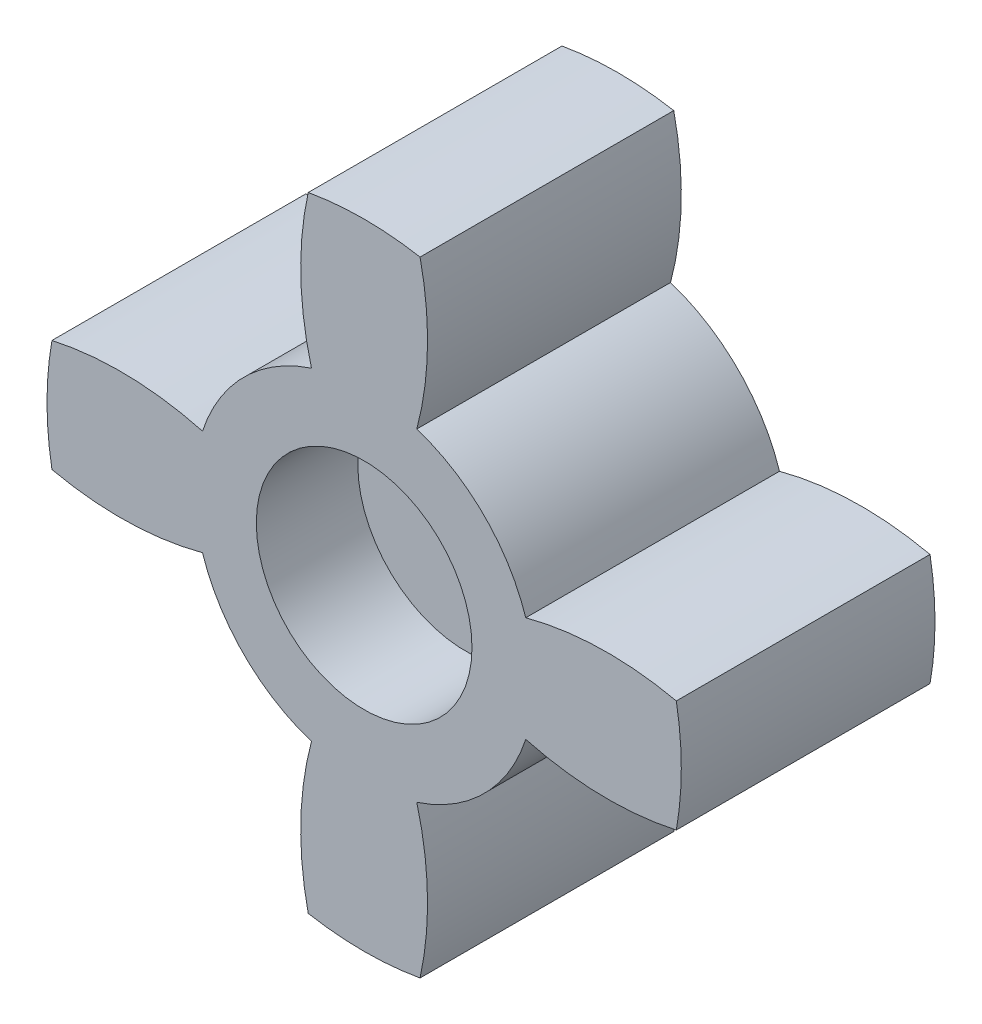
ISO-10303-21;
HEADER;
FILE_DESCRIPTION(('STEP AP214'),'2;1');
FILE_NAME('part.step','',(''),(''),'','','');
FILE_SCHEMA(('AUTOMOTIVE_DESIGN { 1 0 10303 214 1 1 1 1 }'));
ENDSEC;
DATA;
#1=APPLICATION_CONTEXT('core data for automotive mechanical design processes');
#2=APPLICATION_PROTOCOL_DEFINITION('international standard','automotive_design',2000,#1);
#3=PRODUCT_CONTEXT('',#1,'mechanical');
#4=PRODUCT('Part','Part','',(#3));
#5=PRODUCT_RELATED_PRODUCT_CATEGORY('part','',(#4));
#6=PRODUCT_DEFINITION_FORMATION('','',#4);
#7=PRODUCT_DEFINITION_CONTEXT('part definition',#1,'design');
#8=PRODUCT_DEFINITION('design','',#6,#7);
#9=PRODUCT_DEFINITION_SHAPE('','',#8);
#10=(LENGTH_UNIT() NAMED_UNIT(*) SI_UNIT(.MILLI.,.METRE.));
#11=(NAMED_UNIT(*) PLANE_ANGLE_UNIT() SI_UNIT($,.RADIAN.));
#12=(NAMED_UNIT(*) SI_UNIT($,.STERADIAN.) SOLID_ANGLE_UNIT());
#13=UNCERTAINTY_MEASURE_WITH_UNIT(LENGTH_MEASURE(1.E-05),#10,'distance_accuracy_value','');
#14=(GEOMETRIC_REPRESENTATION_CONTEXT(3) GLOBAL_UNCERTAINTY_ASSIGNED_CONTEXT((#13)) GLOBAL_UNIT_ASSIGNED_CONTEXT((#10,
#11,#12)) REPRESENTATION_CONTEXT('',''));
#15=CARTESIAN_POINT('',(0.,0.,0.));
#16=DIRECTION('',(0.,0.,1.));
#17=DIRECTION('',(1.,0.,0.));
#18=AXIS2_PLACEMENT_3D('',#15,#16,#17);
#19=CARTESIAN_POINT('',(0.,0.,10.));
#20=DIRECTION('',(0.,0.,-1.));
#21=DIRECTION('',(-1.,0.,0.));
#22=AXIS2_PLACEMENT_3D('',#19,#20,#21);
#23=CYLINDRICAL_SURFACE('',#22,12.5);
#24=CARTESIAN_POINT('',(0.,0.,10.));
#25=DIRECTION('',(0.,0.,1.));
#26=DIRECTION('',(1.,0.,0.));
#27=AXIS2_PLACEMENT_3D('',#24,#25,#26);
#28=CIRCLE('',#27,12.5);
#29=CARTESIAN_POINT('',(-2.20399556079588,-12.3041620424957,10.));
#30=VERTEX_POINT('',#29);
#31=CARTESIAN_POINT('',(2.20399556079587,-12.3041620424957,10.));
#32=VERTEX_POINT('',#31);
#33=EDGE_CURVE('E25',#30,#32,#28,.T.);
#34=ORIENTED_EDGE('',*,*,#33,.F.);
#35=DIRECTION('',(0.,0.,1.));
#36=VECTOR('',#35,1.);
#37=CARTESIAN_POINT('',(-2.20399556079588,-12.3041620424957,0.));
#38=LINE('',#37,#36);
#39=CARTESIAN_POINT('',(-2.20399556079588,-12.3041620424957,0.));
#40=VERTEX_POINT('',#39);
#41=EDGE_CURVE('E166',#40,#30,#38,.T.);
#42=ORIENTED_EDGE('',*,*,#41,.F.);
#43=CARTESIAN_POINT('',(0.,0.,0.));
#44=DIRECTION('',(0.,0.,1.));
#45=DIRECTION('',(1.,0.,0.));
#46=AXIS2_PLACEMENT_3D('',#43,#44,#45);
#47=CIRCLE('',#46,12.5);
#48=CARTESIAN_POINT('',(2.20399556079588,-12.3041620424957,0.));
#49=VERTEX_POINT('',#48);
#50=EDGE_CURVE('E40',#40,#49,#47,.T.);
#51=ORIENTED_EDGE('',*,*,#50,.T.);
#52=DIRECTION('',(0.,0.,1.));
#53=VECTOR('',#52,1.);
#54=CARTESIAN_POINT('',(2.20399556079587,-12.3041620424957,0.));
#55=LINE('',#54,#53);
#56=EDGE_CURVE('E192',#49,#32,#55,.T.);
#57=ORIENTED_EDGE('',*,*,#56,.T.);
#58=EDGE_LOOP('',(#34,#42,#51,#57));
#59=FACE_BOUND('',#58,.T.);
#60=ADVANCED_FACE('F15',(#59),#23,.T.);
#61=CARTESIAN_POINT('',(12.3041620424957,-2.20399556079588,10.));
#62=VERTEX_POINT('',#61);
#63=CARTESIAN_POINT('',(12.3041620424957,2.20399556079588,10.));
#64=VERTEX_POINT('',#63);
#65=EDGE_CURVE('E262',#62,#64,#28,.T.);
#66=ORIENTED_EDGE('',*,*,#65,.F.);
#67=DIRECTION('',(0.,0.,1.));
#68=VECTOR('',#67,1.);
#69=CARTESIAN_POINT('',(12.3041620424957,-2.20399556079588,0.));
#70=LINE('',#69,#68);
#71=CARTESIAN_POINT('',(12.3041620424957,-2.20399556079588,0.));
#72=VERTEX_POINT('',#71);
#73=EDGE_CURVE('E190',#72,#62,#70,.T.);
#74=ORIENTED_EDGE('',*,*,#73,.F.);
#75=CARTESIAN_POINT('',(12.3041620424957,2.20399556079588,0.));
#76=VERTEX_POINT('',#75);
#77=EDGE_CURVE('E241',#72,#76,#47,.T.);
#78=ORIENTED_EDGE('',*,*,#77,.T.);
#79=DIRECTION('',(0.,0.,1.));
#80=VECTOR('',#79,1.);
#81=CARTESIAN_POINT('',(12.3041620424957,2.20399556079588,0.));
#82=LINE('',#81,#80);
#83=EDGE_CURVE('E244',#76,#64,#82,.T.);
#84=ORIENTED_EDGE('',*,*,#83,.T.);
#85=EDGE_LOOP('',(#66,#74,#78,#84));
#86=FACE_BOUND('',#85,.T.);
#87=ADVANCED_FACE('F275',(#86),#23,.T.);
#88=CARTESIAN_POINT('',(2.20399556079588,12.3041620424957,0.));
#89=VERTEX_POINT('',#88);
#90=CARTESIAN_POINT('',(-2.20399556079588,12.3041620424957,0.));
#91=VERTEX_POINT('',#90);
#92=EDGE_CURVE('E19',#89,#91,#47,.T.);
#93=ORIENTED_EDGE('',*,*,#92,.T.);
#94=DIRECTION('',(0.,0.,1.));
#95=VECTOR('',#94,1.);
#96=CARTESIAN_POINT('',(-2.20399556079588,12.3041620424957,0.));
#97=LINE('',#96,#95);
#98=CARTESIAN_POINT('',(-2.20399556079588,12.3041620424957,10.));
#99=VERTEX_POINT('',#98);
#100=EDGE_CURVE('E205',#91,#99,#97,.T.);
#101=ORIENTED_EDGE('',*,*,#100,.T.);
#102=CARTESIAN_POINT('',(2.20399556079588,12.3041620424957,10.));
#103=VERTEX_POINT('',#102);
#104=EDGE_CURVE('E9',#103,#99,#28,.T.);
#105=ORIENTED_EDGE('',*,*,#104,.F.);
#106=DIRECTION('',(0.,0.,1.));
#107=VECTOR('',#106,1.);
#108=CARTESIAN_POINT('',(2.20399556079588,12.3041620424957,0.));
#109=LINE('',#108,#107);
#110=EDGE_CURVE('E242',#89,#103,#109,.T.);
#111=ORIENTED_EDGE('',*,*,#110,.F.);
#112=EDGE_LOOP('',(#93,#101,#105,#111));
#113=FACE_BOUND('',#112,.T.);
#114=ADVANCED_FACE('F282',(#113),#23,.T.);
#115=CARTESIAN_POINT('',(-12.3041620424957,2.20399556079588,0.));
#116=VERTEX_POINT('',#115);
#117=CARTESIAN_POINT('',(-12.3041620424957,-2.20399556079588,0.));
#118=VERTEX_POINT('',#117);
#119=EDGE_CURVE('E267',#116,#118,#47,.T.);
#120=ORIENTED_EDGE('',*,*,#119,.T.);
#121=DIRECTION('',(0.,0.,1.));
#122=VECTOR('',#121,1.);
#123=CARTESIAN_POINT('',(-12.3041620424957,-2.20399556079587,0.));
#124=LINE('',#123,#122);
#125=CARTESIAN_POINT('',(-12.3041620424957,-2.20399556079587,10.));
#126=VERTEX_POINT('',#125);
#127=EDGE_CURVE('E32',#118,#126,#124,.T.);
#128=ORIENTED_EDGE('',*,*,#127,.T.);
#129=CARTESIAN_POINT('',(-12.3041620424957,2.20399556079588,10.));
#130=VERTEX_POINT('',#129);
#131=EDGE_CURVE('E24',#130,#126,#28,.T.);
#132=ORIENTED_EDGE('',*,*,#131,.F.);
#133=DIRECTION('',(0.,0.,1.));
#134=VECTOR('',#133,1.);
#135=CARTESIAN_POINT('',(-12.3041620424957,2.20399556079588,0.));
#136=LINE('',#135,#134);
#137=EDGE_CURVE('E217',#116,#130,#136,.T.);
#138=ORIENTED_EDGE('',*,*,#137,.F.);
#139=EDGE_LOOP('',(#120,#128,#132,#138));
#140=FACE_BOUND('',#139,.T.);
#141=ADVANCED_FACE('F17',(#140),#23,.T.);
#142=CARTESIAN_POINT('',(0.,0.,10.));
#143=DIRECTION('',(0.,0.,1.));
#144=DIRECTION('',(1.,0.,0.));
#145=AXIS2_PLACEMENT_3D('',#142,#143,#144);
#146=PLANE('',#145);
#147=CARTESIAN_POINT('',(0.,0.,10.));
#148=DIRECTION('',(0.,0.,1.));
#149=DIRECTION('',(1.,0.,0.));
#150=AXIS2_PLACEMENT_3D('',#147,#148,#149);
#151=CIRCLE('',#150,4.25);
#152=CARTESIAN_POINT('',(4.25,0.,10.));
#153=VERTEX_POINT('',#152);
#154=EDGE_CURVE('E486',#153,#153,#151,.T.);
#155=ORIENTED_EDGE('',*,*,#154,.F.);
#156=EDGE_LOOP('',(#155));
#157=FACE_BOUND('',#156,.T.);
#158=CARTESIAN_POINT('',(10.,-9.6,10.));
#159=DIRECTION('',(0.,0.,-1.));
#160=DIRECTION('',(1.,0.,0.));
#161=AXIS2_PLACEMENT_3D('',#158,#159,#160);
#162=CIRCLE('',#161,12.5);
#163=CARTESIAN_POINT('',(-2.07558141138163,-6.37039730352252,10.));
#164=VERTEX_POINT('',#163);
#165=EDGE_CURVE('E150',#30,#164,#162,.T.);
#166=ORIENTED_EDGE('',*,*,#165,.F.);
#167=ORIENTED_EDGE('',*,*,#33,.T.);
#168=CARTESIAN_POINT('',(-10.,-9.6,10.));
#169=DIRECTION('',(0.,0.,-1.));
#170=DIRECTION('',(1.,0.,0.));
#171=AXIS2_PLACEMENT_3D('',#168,#169,#170);
#172=CIRCLE('',#171,12.5);
#173=CARTESIAN_POINT('',(2.07558141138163,-6.37039730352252,10.));
#174=VERTEX_POINT('',#173);
#175=EDGE_CURVE('E182',#174,#32,#172,.T.);
#176=ORIENTED_EDGE('',*,*,#175,.F.);
#177=CARTESIAN_POINT('',(0.,0.,10.));
#178=DIRECTION('',(0.,0.,-1.));
#179=DIRECTION('',(1.,0.,0.));
#180=AXIS2_PLACEMENT_3D('',#177,#178,#179);
#181=CIRCLE('',#180,6.7);
#182=CARTESIAN_POINT('',(6.37039730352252,-2.07558141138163,10.));
#183=VERTEX_POINT('',#182);
#184=EDGE_CURVE('E165',#183,#174,#181,.T.);
#185=ORIENTED_EDGE('',*,*,#184,.F.);
#186=CARTESIAN_POINT('',(9.6,10.,10.));
#187=DIRECTION('',(0.,0.,-1.));
#188=DIRECTION('',(1.,0.,0.));
#189=AXIS2_PLACEMENT_3D('',#186,#187,#188);
#190=CIRCLE('',#189,12.5);
#191=EDGE_CURVE('E173',#62,#183,#190,.T.);
#192=ORIENTED_EDGE('',*,*,#191,.F.);
#193=ORIENTED_EDGE('',*,*,#65,.T.);
#194=CARTESIAN_POINT('',(9.6,-10.,10.));
#195=DIRECTION('',(0.,0.,-1.));
#196=DIRECTION('',(1.,0.,0.));
#197=AXIS2_PLACEMENT_3D('',#194,#195,#196);
#198=CIRCLE('',#197,12.5);
#199=CARTESIAN_POINT('',(6.37039730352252,2.07558141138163,10.));
#200=VERTEX_POINT('',#199);
#201=EDGE_CURVE('E234',#200,#64,#198,.T.);
#202=ORIENTED_EDGE('',*,*,#201,.F.);
#203=CARTESIAN_POINT('',(0.,0.,10.));
#204=DIRECTION('',(0.,0.,-1.));
#205=DIRECTION('',(1.,0.,0.));
#206=AXIS2_PLACEMENT_3D('',#203,#204,#205);
#207=CIRCLE('',#206,6.7);
#208=CARTESIAN_POINT('',(2.07558141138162,6.37039730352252,10.));
#209=VERTEX_POINT('',#208);
#210=EDGE_CURVE('E214',#209,#200,#207,.T.);
#211=ORIENTED_EDGE('',*,*,#210,.F.);
#212=CARTESIAN_POINT('',(-10.,9.6,10.));
#213=DIRECTION('',(0.,0.,-1.));
#214=DIRECTION('',(1.,0.,0.));
#215=AXIS2_PLACEMENT_3D('',#212,#213,#214);
#216=CIRCLE('',#215,12.5);
#217=EDGE_CURVE('E225',#103,#209,#216,.T.);
#218=ORIENTED_EDGE('',*,*,#217,.F.);
#219=ORIENTED_EDGE('',*,*,#104,.T.);
#220=CARTESIAN_POINT('',(10.,9.6,10.));
#221=DIRECTION('',(0.,0.,-1.));
#222=DIRECTION('',(1.,0.,0.));
#223=AXIS2_PLACEMENT_3D('',#220,#221,#222);
#224=CIRCLE('',#223,12.5);
#225=CARTESIAN_POINT('',(-2.07558141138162,6.37039730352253,10.));
#226=VERTEX_POINT('',#225);
#227=EDGE_CURVE('E189',#226,#99,#224,.T.);
#228=ORIENTED_EDGE('',*,*,#227,.F.);
#229=CARTESIAN_POINT('',(0.,0.,10.));
#230=DIRECTION('',(0.,0.,-1.));
#231=DIRECTION('',(1.,0.,0.));
#232=AXIS2_PLACEMENT_3D('',#229,#230,#231);
#233=CIRCLE('',#232,6.7);
#234=CARTESIAN_POINT('',(-6.37039730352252,2.07558141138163,10.));
#235=VERTEX_POINT('',#234);
#236=EDGE_CURVE('E199',#235,#226,#233,.T.);
#237=ORIENTED_EDGE('',*,*,#236,.F.);
#238=CARTESIAN_POINT('',(-9.6,-10.,10.));
#239=DIRECTION('',(0.,0.,-1.));
#240=DIRECTION('',(1.,0.,0.));
#241=AXIS2_PLACEMENT_3D('',#238,#239,#240);
#242=CIRCLE('',#241,12.5);
#243=EDGE_CURVE('E207',#130,#235,#242,.T.);
#244=ORIENTED_EDGE('',*,*,#243,.F.);
#245=ORIENTED_EDGE('',*,*,#131,.T.);
#246=CARTESIAN_POINT('',(-9.6,10.,10.));
#247=DIRECTION('',(0.,0.,-1.));
#248=DIRECTION('',(1.,0.,0.));
#249=AXIS2_PLACEMENT_3D('',#246,#247,#248);
#250=CIRCLE('',#249,12.5);
#251=CARTESIAN_POINT('',(-6.37039730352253,-2.07558141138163,10.));
#252=VERTEX_POINT('',#251);
#253=EDGE_CURVE('E153',#252,#126,#250,.T.);
#254=ORIENTED_EDGE('',*,*,#253,.F.);
#255=CARTESIAN_POINT('',(0.,0.,10.));
#256=DIRECTION('',(0.,0.,-1.));
#257=DIRECTION('',(1.,0.,0.));
#258=AXIS2_PLACEMENT_3D('',#255,#256,#257);
#259=CIRCLE('',#258,6.7);
#260=EDGE_CURVE('E139',#164,#252,#259,.T.);
#261=ORIENTED_EDGE('',*,*,#260,.F.);
#262=EDGE_LOOP('',(#166,#167,#176,#185,#192,#193,#202,#211,#218,#219,#228,#237,#244,#245,#254,#261));
#263=FACE_BOUND('',#262,.T.);
#264=ADVANCED_FACE('F259',(#157,#263),#146,.T.);
#265=CARTESIAN_POINT('',(0.,0.,0.));
#266=DIRECTION('',(0.,0.,1.));
#267=DIRECTION('',(1.,0.,0.));
#268=AXIS2_PLACEMENT_3D('',#265,#266,#267);
#269=PLANE('',#268);
#270=CARTESIAN_POINT('',(0.,0.,0.));
#271=DIRECTION('',(0.,0.,-1.));
#272=DIRECTION('',(-1.,0.,0.));
#273=AXIS2_PLACEMENT_3D('',#270,#271,#272);
#274=CIRCLE('',#273,4.25);
#275=CARTESIAN_POINT('',(-4.25,0.,0.));
#276=VERTEX_POINT('',#275);
#277=EDGE_CURVE('E156',#276,#276,#274,.T.);
#278=ORIENTED_EDGE('',*,*,#277,.F.);
#279=EDGE_LOOP('',(#278));
#280=FACE_BOUND('',#279,.T.);
#281=ORIENTED_EDGE('',*,*,#50,.F.);
#282=CARTESIAN_POINT('',(10.,-9.6,0.));
#283=DIRECTION('',(0.,0.,-1.));
#284=DIRECTION('',(1.,0.,0.));
#285=AXIS2_PLACEMENT_3D('',#282,#283,#284);
#286=CIRCLE('',#285,12.5);
#287=CARTESIAN_POINT('',(-2.07558141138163,-6.37039730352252,0.));
#288=VERTEX_POINT('',#287);
#289=EDGE_CURVE('E141',#40,#288,#286,.T.);
#290=ORIENTED_EDGE('',*,*,#289,.T.);
#291=CARTESIAN_POINT('',(0.,0.,0.));
#292=DIRECTION('',(0.,0.,-1.));
#293=DIRECTION('',(1.,0.,0.));
#294=AXIS2_PLACEMENT_3D('',#291,#292,#293);
#295=CIRCLE('',#294,6.7);
#296=CARTESIAN_POINT('',(-6.37039730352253,-2.07558141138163,0.));
#297=VERTEX_POINT('',#296);
#298=EDGE_CURVE('E136',#288,#297,#295,.T.);
#299=ORIENTED_EDGE('',*,*,#298,.T.);
#300=CARTESIAN_POINT('',(-9.6,10.,0.));
#301=DIRECTION('',(0.,0.,-1.));
#302=DIRECTION('',(1.,0.,0.));
#303=AXIS2_PLACEMENT_3D('',#300,#301,#302);
#304=CIRCLE('',#303,12.5);
#305=EDGE_CURVE('E143',#297,#118,#304,.T.);
#306=ORIENTED_EDGE('',*,*,#305,.T.);
#307=ORIENTED_EDGE('',*,*,#119,.F.);
#308=CARTESIAN_POINT('',(-9.6,-10.,0.));
#309=DIRECTION('',(0.,0.,-1.));
#310=DIRECTION('',(1.,0.,0.));
#311=AXIS2_PLACEMENT_3D('',#308,#309,#310);
#312=CIRCLE('',#311,12.5);
#313=CARTESIAN_POINT('',(-6.37039730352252,2.07558141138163,0.));
#314=VERTEX_POINT('',#313);
#315=EDGE_CURVE('E198',#116,#314,#312,.T.);
#316=ORIENTED_EDGE('',*,*,#315,.T.);
#317=CARTESIAN_POINT('',(0.,0.,0.));
#318=DIRECTION('',(0.,0.,-1.));
#319=DIRECTION('',(1.,0.,0.));
#320=AXIS2_PLACEMENT_3D('',#317,#318,#319);
#321=CIRCLE('',#320,6.7);
#322=CARTESIAN_POINT('',(-2.07558141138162,6.37039730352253,0.));
#323=VERTEX_POINT('',#322);
#324=EDGE_CURVE('E202',#314,#323,#321,.T.);
#325=ORIENTED_EDGE('',*,*,#324,.T.);
#326=CARTESIAN_POINT('',(10.,9.6,0.));
#327=DIRECTION('',(0.,0.,-1.));
#328=DIRECTION('',(1.,0.,0.));
#329=AXIS2_PLACEMENT_3D('',#326,#327,#328);
#330=CIRCLE('',#329,12.5);
#331=EDGE_CURVE('E195',#323,#91,#330,.T.);
#332=ORIENTED_EDGE('',*,*,#331,.T.);
#333=ORIENTED_EDGE('',*,*,#92,.F.);
#334=CARTESIAN_POINT('',(-10.,9.6,0.));
#335=DIRECTION('',(0.,0.,-1.));
#336=DIRECTION('',(1.,0.,0.));
#337=AXIS2_PLACEMENT_3D('',#334,#335,#336);
#338=CIRCLE('',#337,12.5);
#339=CARTESIAN_POINT('',(2.07558141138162,6.37039730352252,0.));
#340=VERTEX_POINT('',#339);
#341=EDGE_CURVE('E228',#89,#340,#338,.T.);
#342=ORIENTED_EDGE('',*,*,#341,.T.);
#343=CARTESIAN_POINT('',(0.,0.,0.));
#344=DIRECTION('',(0.,0.,-1.));
#345=DIRECTION('',(1.,0.,0.));
#346=AXIS2_PLACEMENT_3D('',#343,#344,#345);
#347=CIRCLE('',#346,6.7);
#348=CARTESIAN_POINT('',(6.37039730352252,2.07558141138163,0.));
#349=VERTEX_POINT('',#348);
#350=EDGE_CURVE('E221',#340,#349,#347,.T.);
#351=ORIENTED_EDGE('',*,*,#350,.T.);
#352=CARTESIAN_POINT('',(9.6,-10.,0.));
#353=DIRECTION('',(0.,0.,-1.));
#354=DIRECTION('',(1.,0.,0.));
#355=AXIS2_PLACEMENT_3D('',#352,#353,#354);
#356=CIRCLE('',#355,12.5);
#357=EDGE_CURVE('E224',#349,#76,#356,.T.);
#358=ORIENTED_EDGE('',*,*,#357,.T.);
#359=ORIENTED_EDGE('',*,*,#77,.F.);
#360=CARTESIAN_POINT('',(9.6,10.,0.));
#361=DIRECTION('',(0.,0.,-1.));
#362=DIRECTION('',(1.,0.,0.));
#363=AXIS2_PLACEMENT_3D('',#360,#361,#362);
#364=CIRCLE('',#363,12.5);
#365=CARTESIAN_POINT('',(6.37039730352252,-2.07558141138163,0.));
#366=VERTEX_POINT('',#365);
#367=EDGE_CURVE('E176',#72,#366,#364,.T.);
#368=ORIENTED_EDGE('',*,*,#367,.T.);
#369=CARTESIAN_POINT('',(0.,0.,0.));
#370=DIRECTION('',(0.,0.,-1.));
#371=DIRECTION('',(1.,0.,0.));
#372=AXIS2_PLACEMENT_3D('',#369,#370,#371);
#373=CIRCLE('',#372,6.7);
#374=CARTESIAN_POINT('',(2.07558141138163,-6.37039730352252,0.));
#375=VERTEX_POINT('',#374);
#376=EDGE_CURVE('E169',#366,#375,#373,.T.);
#377=ORIENTED_EDGE('',*,*,#376,.T.);
#378=CARTESIAN_POINT('',(-10.,-9.6,0.));
#379=DIRECTION('',(0.,0.,-1.));
#380=DIRECTION('',(1.,0.,0.));
#381=AXIS2_PLACEMENT_3D('',#378,#379,#380);
#382=CIRCLE('',#381,12.5);
#383=EDGE_CURVE('E172',#375,#49,#382,.T.);
#384=ORIENTED_EDGE('',*,*,#383,.T.);
#385=EDGE_LOOP('',(#281,#290,#299,#306,#307,#316,#325,#332,#333,#342,#351,#358,#359,#368,#377,#384));
#386=FACE_BOUND('',#385,.T.);
#387=ADVANCED_FACE('F149',(#280,#386),#269,.F.);
#388=CARTESIAN_POINT('',(0.,0.,0.));
#389=DIRECTION('',(0.,0.,1.));
#390=DIRECTION('',(1.,0.,0.));
#391=AXIS2_PLACEMENT_3D('',#388,#389,#390);
#392=CYLINDRICAL_SURFACE('',#391,6.7);
#393=ORIENTED_EDGE('',*,*,#210,.T.);
#394=DIRECTION('',(0.,0.,1.));
#395=VECTOR('',#394,1.);
#396=CARTESIAN_POINT('',(6.37039730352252,2.07558141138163,0.));
#397=LINE('',#396,#395);
#398=EDGE_CURVE('E231',#349,#200,#397,.T.);
#399=ORIENTED_EDGE('',*,*,#398,.F.);
#400=ORIENTED_EDGE('',*,*,#350,.F.);
#401=DIRECTION('',(0.,0.,1.));
#402=VECTOR('',#401,1.);
#403=CARTESIAN_POINT('',(2.07558141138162,6.37039730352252,0.));
#404=LINE('',#403,#402);
#405=EDGE_CURVE('E239',#340,#209,#404,.T.);
#406=ORIENTED_EDGE('',*,*,#405,.T.);
#407=EDGE_LOOP('',(#393,#399,#400,#406));
#408=FACE_BOUND('',#407,.T.);
#409=ADVANCED_FACE('F255',(#408),#392,.T.);
#410=CARTESIAN_POINT('',(-10.,9.6,0.));
#411=DIRECTION('',(0.,0.,1.));
#412=DIRECTION('',(1.,0.,0.));
#413=AXIS2_PLACEMENT_3D('',#410,#411,#412);
#414=CYLINDRICAL_SURFACE('',#413,12.5);
#415=ORIENTED_EDGE('',*,*,#217,.T.);
#416=ORIENTED_EDGE('',*,*,#405,.F.);
#417=ORIENTED_EDGE('',*,*,#341,.F.);
#418=ORIENTED_EDGE('',*,*,#110,.T.);
#419=EDGE_LOOP('',(#415,#416,#417,#418));
#420=FACE_BOUND('',#419,.T.);
#421=ADVANCED_FACE('F279',(#420),#414,.T.);
#422=CARTESIAN_POINT('',(9.6,-10.,0.));
#423=DIRECTION('',(0.,0.,1.));
#424=DIRECTION('',(1.,0.,0.));
#425=AXIS2_PLACEMENT_3D('',#422,#423,#424);
#426=CYLINDRICAL_SURFACE('',#425,12.5);
#427=ORIENTED_EDGE('',*,*,#201,.T.);
#428=ORIENTED_EDGE('',*,*,#83,.F.);
#429=ORIENTED_EDGE('',*,*,#357,.F.);
#430=ORIENTED_EDGE('',*,*,#398,.T.);
#431=EDGE_LOOP('',(#427,#428,#429,#430));
#432=FACE_BOUND('',#431,.T.);
#433=ADVANCED_FACE('F249',(#432),#426,.T.);
#434=CARTESIAN_POINT('',(10.,9.6,0.));
#435=DIRECTION('',(0.,0.,1.));
#436=DIRECTION('',(1.,0.,0.));
#437=AXIS2_PLACEMENT_3D('',#434,#435,#436);
#438=CYLINDRICAL_SURFACE('',#437,12.5);
#439=ORIENTED_EDGE('',*,*,#227,.T.);
#440=ORIENTED_EDGE('',*,*,#100,.F.);
#441=ORIENTED_EDGE('',*,*,#331,.F.);
#442=DIRECTION('',(0.,0.,1.));
#443=VECTOR('',#442,1.);
#444=CARTESIAN_POINT('',(-2.07558141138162,6.37039730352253,0.));
#445=LINE('',#444,#443);
#446=EDGE_CURVE('E212',#323,#226,#445,.T.);
#447=ORIENTED_EDGE('',*,*,#446,.T.);
#448=EDGE_LOOP('',(#439,#440,#441,#447));
#449=FACE_BOUND('',#448,.T.);
#450=ADVANCED_FACE('F285',(#449),#438,.T.);
#451=CARTESIAN_POINT('',(0.,0.,0.));
#452=DIRECTION('',(0.,0.,1.));
#453=DIRECTION('',(1.,0.,0.));
#454=AXIS2_PLACEMENT_3D('',#451,#452,#453);
#455=CYLINDRICAL_SURFACE('',#454,6.7);
#456=ORIENTED_EDGE('',*,*,#236,.T.);
#457=ORIENTED_EDGE('',*,*,#446,.F.);
#458=ORIENTED_EDGE('',*,*,#324,.F.);
#459=DIRECTION('',(0.,0.,1.));
#460=VECTOR('',#459,1.);
#461=CARTESIAN_POINT('',(-6.37039730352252,2.07558141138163,0.));
#462=LINE('',#461,#460);
#463=EDGE_CURVE('E215',#314,#235,#462,.T.);
#464=ORIENTED_EDGE('',*,*,#463,.T.);
#465=EDGE_LOOP('',(#456,#457,#458,#464));
#466=FACE_BOUND('',#465,.T.);
#467=ADVANCED_FACE('F288',(#466),#455,.T.);
#468=CARTESIAN_POINT('',(-9.6,-10.,0.));
#469=DIRECTION('',(0.,0.,1.));
#470=DIRECTION('',(1.,0.,0.));
#471=AXIS2_PLACEMENT_3D('',#468,#469,#470);
#472=CYLINDRICAL_SURFACE('',#471,12.5);
#473=ORIENTED_EDGE('',*,*,#243,.T.);
#474=ORIENTED_EDGE('',*,*,#463,.F.);
#475=ORIENTED_EDGE('',*,*,#315,.F.);
#476=ORIENTED_EDGE('',*,*,#137,.T.);
#477=EDGE_LOOP('',(#473,#474,#475,#476));
#478=FACE_BOUND('',#477,.T.);
#479=ADVANCED_FACE('F291',(#478),#472,.T.);
#480=CARTESIAN_POINT('',(0.,0.,0.));
#481=DIRECTION('',(0.,0.,1.));
#482=DIRECTION('',(1.,0.,0.));
#483=AXIS2_PLACEMENT_3D('',#480,#481,#482);
#484=CYLINDRICAL_SURFACE('',#483,6.7);
#485=ORIENTED_EDGE('',*,*,#184,.T.);
#486=DIRECTION('',(0.,0.,1.));
#487=VECTOR('',#486,1.);
#488=CARTESIAN_POINT('',(2.07558141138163,-6.37039730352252,0.));
#489=LINE('',#488,#487);
#490=EDGE_CURVE('E179',#375,#174,#489,.T.);
#491=ORIENTED_EDGE('',*,*,#490,.F.);
#492=ORIENTED_EDGE('',*,*,#376,.F.);
#493=DIRECTION('',(0.,0.,1.));
#494=VECTOR('',#493,1.);
#495=CARTESIAN_POINT('',(6.37039730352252,-2.07558141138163,0.));
#496=LINE('',#495,#494);
#497=EDGE_CURVE('E187',#366,#183,#496,.T.);
#498=ORIENTED_EDGE('',*,*,#497,.T.);
#499=EDGE_LOOP('',(#485,#491,#492,#498));
#500=FACE_BOUND('',#499,.T.);
#501=ADVANCED_FACE('F293',(#500),#484,.T.);
#502=CARTESIAN_POINT('',(9.6,10.,0.));
#503=DIRECTION('',(0.,0.,1.));
#504=DIRECTION('',(1.,0.,0.));
#505=AXIS2_PLACEMENT_3D('',#502,#503,#504);
#506=CYLINDRICAL_SURFACE('',#505,12.5);
#507=ORIENTED_EDGE('',*,*,#191,.T.);
#508=ORIENTED_EDGE('',*,*,#497,.F.);
#509=ORIENTED_EDGE('',*,*,#367,.F.);
#510=ORIENTED_EDGE('',*,*,#73,.T.);
#511=EDGE_LOOP('',(#507,#508,#509,#510));
#512=FACE_BOUND('',#511,.T.);
#513=ADVANCED_FACE('F301',(#512),#506,.T.);
#514=CARTESIAN_POINT('',(-10.,-9.6,0.));
#515=DIRECTION('',(0.,0.,1.));
#516=DIRECTION('',(1.,0.,0.));
#517=AXIS2_PLACEMENT_3D('',#514,#515,#516);
#518=CYLINDRICAL_SURFACE('',#517,12.5);
#519=ORIENTED_EDGE('',*,*,#175,.T.);
#520=ORIENTED_EDGE('',*,*,#56,.F.);
#521=ORIENTED_EDGE('',*,*,#383,.F.);
#522=ORIENTED_EDGE('',*,*,#490,.T.);
#523=EDGE_LOOP('',(#519,#520,#521,#522));
#524=FACE_BOUND('',#523,.T.);
#525=ADVANCED_FACE('F405',(#524),#518,.T.);
#526=CARTESIAN_POINT('',(0.,0.,0.));
#527=DIRECTION('',(0.,0.,1.));
#528=DIRECTION('',(1.,0.,0.));
#529=AXIS2_PLACEMENT_3D('',#526,#527,#528);
#530=CYLINDRICAL_SURFACE('',#529,6.7);
#531=ORIENTED_EDGE('',*,*,#260,.T.);
#532=DIRECTION('',(0.,0.,1.));
#533=VECTOR('',#532,1.);
#534=CARTESIAN_POINT('',(-6.37039730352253,-2.07558141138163,0.));
#535=LINE('',#534,#533);
#536=EDGE_CURVE('E133',#297,#252,#535,.T.);
#537=ORIENTED_EDGE('',*,*,#536,.F.);
#538=ORIENTED_EDGE('',*,*,#298,.F.);
#539=DIRECTION('',(0.,0.,1.));
#540=VECTOR('',#539,1.);
#541=CARTESIAN_POINT('',(-2.07558141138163,-6.37039730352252,0.));
#542=LINE('',#541,#540);
#543=EDGE_CURVE('E163',#288,#164,#542,.T.);
#544=ORIENTED_EDGE('',*,*,#543,.T.);
#545=EDGE_LOOP('',(#531,#537,#538,#544));
#546=FACE_BOUND('',#545,.T.);
#547=ADVANCED_FACE('F134',(#546),#530,.T.);
#548=CARTESIAN_POINT('',(10.,-9.6,0.));
#549=DIRECTION('',(0.,0.,1.));
#550=DIRECTION('',(1.,0.,0.));
#551=AXIS2_PLACEMENT_3D('',#548,#549,#550);
#552=CYLINDRICAL_SURFACE('',#551,12.5);
#553=ORIENTED_EDGE('',*,*,#165,.T.);
#554=ORIENTED_EDGE('',*,*,#543,.F.);
#555=ORIENTED_EDGE('',*,*,#289,.F.);
#556=ORIENTED_EDGE('',*,*,#41,.T.);
#557=EDGE_LOOP('',(#553,#554,#555,#556));
#558=FACE_BOUND('',#557,.T.);
#559=ADVANCED_FACE('F421',(#558),#552,.T.);
#560=CARTESIAN_POINT('',(-9.6,10.,0.));
#561=DIRECTION('',(0.,0.,1.));
#562=DIRECTION('',(1.,0.,0.));
#563=AXIS2_PLACEMENT_3D('',#560,#561,#562);
#564=CYLINDRICAL_SURFACE('',#563,12.5);
#565=ORIENTED_EDGE('',*,*,#253,.T.);
#566=ORIENTED_EDGE('',*,*,#127,.F.);
#567=ORIENTED_EDGE('',*,*,#305,.F.);
#568=ORIENTED_EDGE('',*,*,#536,.T.);
#569=EDGE_LOOP('',(#565,#566,#567,#568));
#570=FACE_BOUND('',#569,.T.);
#571=ADVANCED_FACE('F144',(#570),#564,.T.);
#572=CARTESIAN_POINT('',(0.,0.,4.));
#573=DIRECTION('',(0.,0.,-1.));
#574=DIRECTION('',(-1.,0.,0.));
#575=AXIS2_PLACEMENT_3D('',#572,#573,#574);
#576=CYLINDRICAL_SURFACE('',#575,4.25);
#577=CARTESIAN_POINT('',(0.,0.,4.));
#578=DIRECTION('',(0.,0.,-1.));
#579=DIRECTION('',(-1.,0.,0.));
#580=AXIS2_PLACEMENT_3D('',#577,#578,#579);
#581=CIRCLE('',#580,4.25);
#582=CARTESIAN_POINT('',(-4.25,0.,4.));
#583=VERTEX_POINT('',#582);
#584=EDGE_CURVE('E161',#583,#583,#581,.T.);
#585=ORIENTED_EDGE('',*,*,#584,.F.);
#586=EDGE_LOOP('',(#585));
#587=FACE_BOUND('',#586,.T.);
#588=ORIENTED_EDGE('',*,*,#277,.T.);
#589=EDGE_LOOP('',(#588));
#590=FACE_BOUND('',#589,.T.);
#591=ADVANCED_FACE('F437',(#587,#590),#576,.F.);
#592=CARTESIAN_POINT('',(0.,0.,4.));
#593=DIRECTION('',(0.,0.,-1.));
#594=DIRECTION('',(-1.,0.,0.));
#595=AXIS2_PLACEMENT_3D('',#592,#593,#594);
#596=PLANE('',#595);
#597=ORIENTED_EDGE('',*,*,#584,.T.);
#598=EDGE_LOOP('',(#597));
#599=FACE_BOUND('',#598,.T.);
#600=ADVANCED_FACE('F445',(#599),#596,.T.);
#601=CARTESIAN_POINT('',(0.,0.,6.));
#602=DIRECTION('',(0.,0.,1.));
#603=DIRECTION('',(1.,0.,0.));
#604=AXIS2_PLACEMENT_3D('',#601,#602,#603);
#605=CYLINDRICAL_SURFACE('',#604,4.25);
#606=CARTESIAN_POINT('',(0.,0.,6.));
#607=DIRECTION('',(0.,0.,1.));
#608=DIRECTION('',(1.,0.,0.));
#609=AXIS2_PLACEMENT_3D('',#606,#607,#608);
#610=CIRCLE('',#609,4.25);
#611=CARTESIAN_POINT('',(4.25,0.,6.));
#612=VERTEX_POINT('',#611);
#613=EDGE_CURVE('E485',#612,#612,#610,.T.);
#614=ORIENTED_EDGE('',*,*,#613,.F.);
#615=EDGE_LOOP('',(#614));
#616=FACE_BOUND('',#615,.T.);
#617=ORIENTED_EDGE('',*,*,#154,.T.);
#618=EDGE_LOOP('',(#617));
#619=FACE_BOUND('',#618,.T.);
#620=ADVANCED_FACE('F454',(#616,#619),#605,.F.);
#621=CARTESIAN_POINT('',(0.,0.,6.));
#622=DIRECTION('',(0.,0.,1.));
#623=DIRECTION('',(1.,0.,0.));
#624=AXIS2_PLACEMENT_3D('',#621,#622,#623);
#625=PLANE('',#624);
#626=ORIENTED_EDGE('',*,*,#613,.T.);
#627=EDGE_LOOP('',(#626));
#628=FACE_BOUND('',#627,.T.);
#629=ADVANCED_FACE('F463',(#628),#625,.T.);
#630=CLOSED_SHELL('',(#60,#87,#114,#141,#264,#387,#409,#421,#433,#450,#467,#479,#501,#513,#525,
#547,#559,#571,#591,#600,#620,#629));
#631=MANIFOLD_SOLID_BREP('B1',#630);
#632=ADVANCED_BREP_SHAPE_REPRESENTATION('',(#18,#631),#14);
#633=SHAPE_DEFINITION_REPRESENTATION(#9,#632);
ENDSEC;
END-ISO-10303-21;
